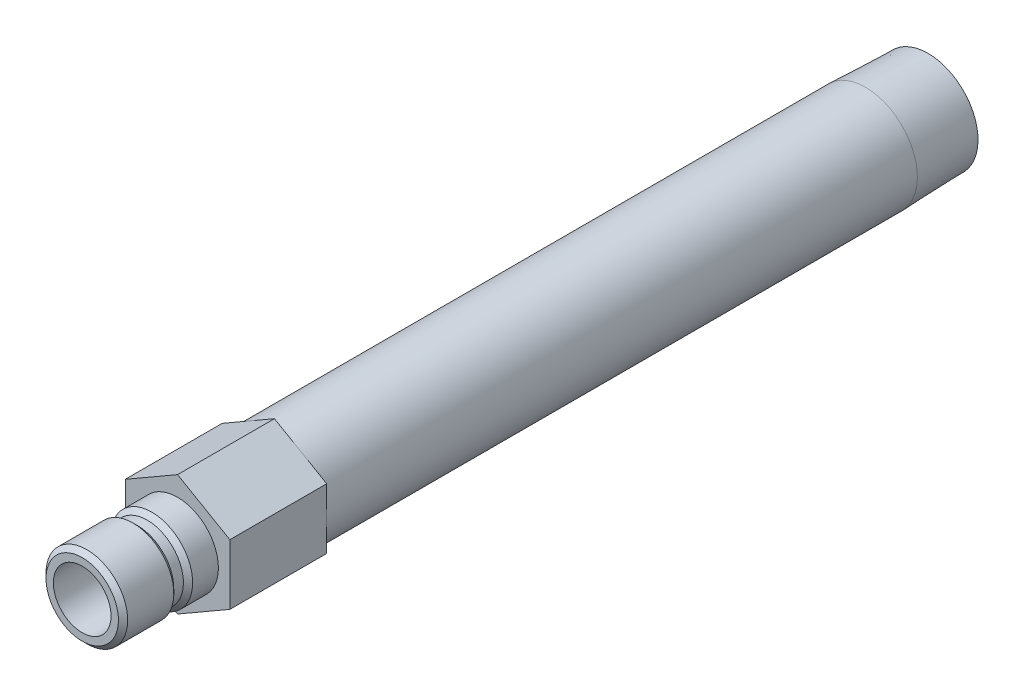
from build123d import *

# Parameters (mm, degrees)
SKETCH2_R           = 4.7625
BOSS_EXTRUDE1_DEPTH = 16.002


with BuildPart() as part:
    # Sketch1 → Revolve1 (revolve)
    with BuildSketch(Plane(origin=(0, 0, 0), x_dir=(0, 0, -1), z_dir=(1, 0, 0))):
        Polygon((-15.748, 4.7625), (-15.748, 5.9817), (-14.986, 6.7437), (-7.366, 6.7437), (-6.604, 5.9817), (-5.0165, 5.9817), (-4.2545, 6.7437), (0, 6.7437), (0, 8.5725), (113.6142, 8.5725), (123.952, 8.249445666), (123.952, 6.2611), (16.002, 6.2611), (16.002, 4.7625), align=None)
    revolve(axis=Axis((0, 0, 0), (0, 0, 1)))

    # Sketch2 → Boss-Extrude1 (add)
    with BuildSketch(Plane.XY):
        Polygon((-8.636, 4.985996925), (-8.636, -4.985996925), (0, -9.971993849), (8.636, -4.985996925), (8.636, 4.985996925), (0, 9.971993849), align=None)
        with Locations(Location((0, 0, 0), (0, 0, 90))):
            Circle(SKETCH2_R, mode=Mode.SUBTRACT)
    extrude(amount=-BOSS_EXTRUDE1_DEPTH)


solid = part.part
